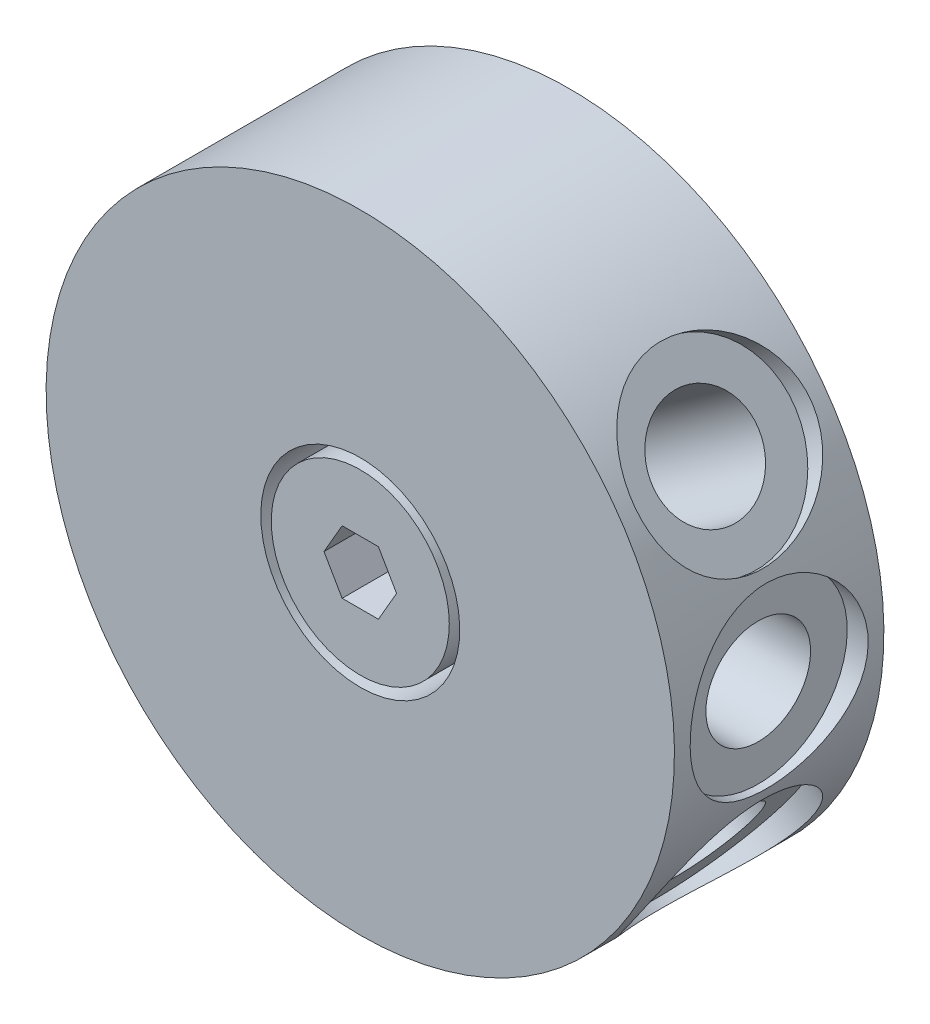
ISO-10303-21;
HEADER;
FILE_DESCRIPTION(('STEP AP214'),'2;1');
FILE_NAME('part.step','',(''),(''),'','','');
FILE_SCHEMA(('AUTOMOTIVE_DESIGN { 1 0 10303 214 1 1 1 1 }'));
ENDSEC;
DATA;
#1=APPLICATION_CONTEXT('core data for automotive mechanical design processes');
#2=APPLICATION_PROTOCOL_DEFINITION('international standard','automotive_design',2000,#1);
#3=PRODUCT_CONTEXT('',#1,'mechanical');
#4=PRODUCT('Part','Part','',(#3));
#5=PRODUCT_RELATED_PRODUCT_CATEGORY('part','',(#4));
#6=PRODUCT_DEFINITION_FORMATION('','',#4);
#7=PRODUCT_DEFINITION_CONTEXT('part definition',#1,'design');
#8=PRODUCT_DEFINITION('design','',#6,#7);
#9=PRODUCT_DEFINITION_SHAPE('','',#8);
#10=(LENGTH_UNIT() NAMED_UNIT(*) SI_UNIT(.MILLI.,.METRE.));
#11=(NAMED_UNIT(*) PLANE_ANGLE_UNIT() SI_UNIT($,.RADIAN.));
#12=(NAMED_UNIT(*) SI_UNIT($,.STERADIAN.) SOLID_ANGLE_UNIT());
#13=UNCERTAINTY_MEASURE_WITH_UNIT(LENGTH_MEASURE(1.E-05),#10,'distance_accuracy_value','');
#14=(GEOMETRIC_REPRESENTATION_CONTEXT(3) GLOBAL_UNCERTAINTY_ASSIGNED_CONTEXT((#13)) GLOBAL_UNIT_ASSIGNED_CONTEXT((#10,
#11,#12)) REPRESENTATION_CONTEXT('',''));
#15=CARTESIAN_POINT('',(0.,0.,0.));
#16=DIRECTION('',(0.,0.,1.));
#17=DIRECTION('',(1.,0.,0.));
#18=AXIS2_PLACEMENT_3D('',#15,#16,#17);
#19=CARTESIAN_POINT('',(7.,0.,5.));
#20=DIRECTION('',(1.,0.,0.));
#21=DIRECTION('',(0.,0.,-1.));
#22=AXIS2_PLACEMENT_3D('',#19,#20,#21);
#23=PLANE('',#22);
#24=CARTESIAN_POINT('',(7.,0.,5.));
#25=DIRECTION('',(1.,0.,0.));
#26=DIRECTION('',(0.,1.,0.));
#27=AXIS2_PLACEMENT_3D('',#24,#25,#26);
#28=CIRCLE('',#27,2.5);
#29=CARTESIAN_POINT('',(7.,2.20709152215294,6.17420058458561));
#30=VERTEX_POINT('',#29);
#31=CARTESIAN_POINT('',(7.,-2.20709152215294,6.17420058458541));
#32=VERTEX_POINT('',#31);
#33=EDGE_CURVE('E167',#30,#32,#28,.T.);
#34=ORIENTED_EDGE('',*,*,#33,.T.);
#35=DIRECTION('',(0.,0.,-1.));
#36=VECTOR('',#35,1.);
#37=CARTESIAN_POINT('',(7.,-2.20709152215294,5.));
#38=LINE('',#37,#36);
#39=CARTESIAN_POINT('',(7.,-2.20709152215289,3.82579941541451));
#40=VERTEX_POINT('',#39);
#41=EDGE_CURVE('E126',#32,#40,#38,.T.);
#42=ORIENTED_EDGE('',*,*,#41,.T.);
#43=CARTESIAN_POINT('',(7.,2.20709152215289,3.82579941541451));
#44=VERTEX_POINT('',#43);
#45=EDGE_CURVE('E166',#40,#44,#28,.T.);
#46=ORIENTED_EDGE('',*,*,#45,.T.);
#47=DIRECTION('',(0.,0.,1.));
#48=VECTOR('',#47,1.);
#49=CARTESIAN_POINT('',(7.,2.20709152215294,7.1));
#50=LINE('',#49,#48);
#51=EDGE_CURVE('E136',#44,#30,#50,.T.);
#52=ORIENTED_EDGE('',*,*,#51,.T.);
#53=EDGE_LOOP('',(#34,#42,#46,#52));
#54=FACE_BOUND('',#53,.T.);
#55=ADVANCED_FACE('F14',(#54),#23,.T.);
#56=CARTESIAN_POINT('',(4.,0.,5.));
#57=DIRECTION('',(1.,0.,0.));
#58=DIRECTION('',(0.,0.,-1.));
#59=AXIS2_PLACEMENT_3D('',#56,#57,#58);
#60=CYLINDRICAL_SURFACE('',#59,2.5);
#61=CARTESIAN_POINT('',(14.,0.,5.));
#62=DIRECTION('',(1.,0.,0.));
#63=DIRECTION('',(0.,1.,0.));
#64=AXIS2_PLACEMENT_3D('',#61,#62,#63);
#65=CIRCLE('',#64,2.5);
#66=CARTESIAN_POINT('',(14.,2.5,5.));
#67=VERTEX_POINT('',#66);
#68=EDGE_CURVE('E170',#67,#67,#65,.T.);
#69=ORIENTED_EDGE('',*,*,#68,.T.);
#70=EDGE_LOOP('',(#69));
#71=FACE_BOUND('',#70,.T.);
#72=CARTESIAN_POINT('',(0.,0.,5.));
#73=DIRECTION('',(0.300705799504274,0.953716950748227,0.));
#74=DIRECTION('',(0.953716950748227,-0.300705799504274,0.));
#75=AXIS2_PLACEMENT_3D('',#72,#73,#74);
#76=ELLIPSE('',#75,8.31377380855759,2.5);
#77=EDGE_CURVE('E22',#32,#40,#76,.T.);
#78=ORIENTED_EDGE('',*,*,#77,.F.);
#79=ORIENTED_EDGE('',*,*,#33,.F.);
#80=CARTESIAN_POINT('',(0.,0.,5.));
#81=DIRECTION('',(-0.300705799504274,0.953716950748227,0.));
#82=DIRECTION('',(0.953716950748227,0.300705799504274,0.));
#83=AXIS2_PLACEMENT_3D('',#80,#81,#82);
#84=ELLIPSE('',#83,8.31377380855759,2.5);
#85=EDGE_CURVE('E139',#30,#44,#84,.T.);
#86=ORIENTED_EDGE('',*,*,#85,.T.);
#87=ORIENTED_EDGE('',*,*,#45,.F.);
#88=EDGE_LOOP('',(#78,#79,#86,#87));
#89=FACE_BOUND('',#88,.T.);
#90=ADVANCED_FACE('F225',(#71,#89),#60,.F.);
#91=CARTESIAN_POINT('',(5.73406431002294,4.01503505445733,7.1));
#92=DIRECTION('',(-0.819152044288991,-0.573576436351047,0.));
#93=DIRECTION('',(0.573576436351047,-0.819152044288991,0.));
#94=AXIS2_PLACEMENT_3D('',#91,#92,#93);
#95=PLANE('',#94);
#96=ORIENTED_EDGE('',*,*,#51,.F.);
#97=CARTESIAN_POINT('',(5.73406431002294,4.01503505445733,5.));
#98=DIRECTION('',(0.819152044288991,0.573576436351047,0.));
#99=DIRECTION('',(-0.573576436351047,0.819152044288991,0.));
#100=AXIS2_PLACEMENT_3D('',#97,#98,#99);
#101=CIRCLE('',#100,2.5);
#102=EDGE_CURVE('E150',#44,#30,#101,.T.);
#103=ORIENTED_EDGE('',*,*,#102,.T.);
#104=EDGE_LOOP('',(#96,#103));
#105=FACE_BOUND('',#104,.T.);
#106=ADVANCED_FACE('F232',(#105),#95,.F.);
#107=CARTESIAN_POINT('',(11.4681286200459,8.03007010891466,5.));
#108=DIRECTION('',(0.819152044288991,0.573576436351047,0.));
#109=DIRECTION('',(-0.573576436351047,0.819152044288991,0.));
#110=AXIS2_PLACEMENT_3D('',#107,#108,#109);
#111=CYLINDRICAL_SURFACE('',#110,2.5);
#112=CARTESIAN_POINT('',(11.4681286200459,8.03007010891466,5.));
#113=DIRECTION('',(0.819152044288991,0.573576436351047,0.));
#114=DIRECTION('',(-0.573576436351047,0.819152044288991,0.));
#115=AXIS2_PLACEMENT_3D('',#112,#113,#114);
#116=CIRCLE('',#115,2.5);
#117=CARTESIAN_POINT('',(10.0341875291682,10.0779502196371,5.));
#118=VERTEX_POINT('',#117);
#119=EDGE_CURVE('E153',#118,#118,#116,.T.);
#120=ORIENTED_EDGE('',*,*,#119,.T.);
#121=EDGE_LOOP('',(#120));
#122=FACE_BOUND('',#121,.T.);
#123=ORIENTED_EDGE('',*,*,#85,.F.);
#124=ORIENTED_EDGE('',*,*,#102,.F.);
#125=EDGE_LOOP('',(#123,#124));
#126=FACE_BOUND('',#125,.T.);
#127=ADVANCED_FACE('F240',(#122,#126),#111,.F.);
#128=CARTESIAN_POINT('',(0.,0.,6.5));
#129=DIRECTION('',(0.,0.,1.));
#130=DIRECTION('',(0.,-1.,0.));
#131=AXIS2_PLACEMENT_3D('',#128,#129,#130);
#132=PLANE('',#131);
#133=CARTESIAN_POINT('',(0.,0.,6.5));
#134=DIRECTION('',(0.,0.,1.));
#135=DIRECTION('',(1.,0.,0.));
#136=AXIS2_PLACEMENT_3D('',#133,#134,#135);
#137=CIRCLE('',#136,4.25);
#138=CARTESIAN_POINT('',(4.25,0.,6.5));
#139=VERTEX_POINT('',#138);
#140=EDGE_CURVE('E270',#139,#139,#137,.F.);
#141=ORIENTED_EDGE('',*,*,#140,.T.);
#142=EDGE_LOOP('',(#141));
#143=FACE_BOUND('',#142,.T.);
#144=CARTESIAN_POINT('',(0.,0.,6.5));
#145=DIRECTION('',(0.,0.,1.));
#146=DIRECTION('',(0.,-1.,0.));
#147=AXIS2_PLACEMENT_3D('',#144,#145,#146);
#148=CIRCLE('',#147,4.75);
#149=CARTESIAN_POINT('',(0.,-4.75,6.5));
#150=VERTEX_POINT('',#149);
#151=EDGE_CURVE('E146',#150,#150,#148,.T.);
#152=ORIENTED_EDGE('',*,*,#151,.T.);
#153=EDGE_LOOP('',(#152));
#154=FACE_BOUND('',#153,.T.);
#155=ADVANCED_FACE('F237',(#143,#154),#132,.T.);
#156=CARTESIAN_POINT('',(0.,0.,10.));
#157=DIRECTION('',(0.,0.,-1.));
#158=DIRECTION('',(0.131774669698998,0.991279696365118,0.));
#159=AXIS2_PLACEMENT_3D('',#156,#157,#158);
#160=CYLINDRICAL_SURFACE('',#159,4.25);
#161=ORIENTED_EDGE('',*,*,#140,.F.);
#162=EDGE_LOOP('',(#161));
#163=FACE_BOUND('',#162,.T.);
#164=CARTESIAN_POINT('',(0.,0.,10.));
#165=DIRECTION('',(0.,0.,1.));
#166=DIRECTION('',(-0.131774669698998,-0.991279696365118,0.));
#167=AXIS2_PLACEMENT_3D('',#164,#165,#166);
#168=CIRCLE('',#167,4.25);
#169=CARTESIAN_POINT('',(-0.560042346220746,-4.21293870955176,10.));
#170=VERTEX_POINT('',#169);
#171=EDGE_CURVE('E147',#170,#170,#168,.T.);
#172=ORIENTED_EDGE('',*,*,#171,.F.);
#173=EDGE_LOOP('',(#172));
#174=FACE_BOUND('',#173,.T.);
#175=ADVANCED_FACE('F16',(#163,#174),#160,.T.);
#176=CARTESIAN_POINT('',(5.73406431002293,-4.01503505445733,7.1));
#177=DIRECTION('',(-0.819152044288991,0.573576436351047,0.));
#178=DIRECTION('',(-0.573576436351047,-0.819152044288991,0.));
#179=AXIS2_PLACEMENT_3D('',#176,#177,#178);
#180=PLANE('',#179);
#181=CARTESIAN_POINT('',(5.73406431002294,-4.01503505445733,5.));
#182=DIRECTION('',(0.819152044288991,-0.573576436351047,0.));
#183=DIRECTION('',(0.573576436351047,0.819152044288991,0.));
#184=AXIS2_PLACEMENT_3D('',#181,#182,#183);
#185=CIRCLE('',#184,2.5);
#186=EDGE_CURVE('E36',#32,#40,#185,.T.);
#187=ORIENTED_EDGE('',*,*,#186,.T.);
#188=ORIENTED_EDGE('',*,*,#41,.F.);
#189=EDGE_LOOP('',(#187,#188));
#190=FACE_BOUND('',#189,.T.);
#191=ADVANCED_FACE('F246',(#190),#180,.F.);
#192=CARTESIAN_POINT('',(0.,0.,6.5));
#193=DIRECTION('',(0.,0.,1.));
#194=DIRECTION('',(0.,-1.,0.));
#195=AXIS2_PLACEMENT_3D('',#192,#193,#194);
#196=CYLINDRICAL_SURFACE('',#195,4.75);
#197=ORIENTED_EDGE('',*,*,#151,.F.);
#198=EDGE_LOOP('',(#197));
#199=FACE_BOUND('',#198,.T.);
#200=CARTESIAN_POINT('',(0.,0.,10.));
#201=DIRECTION('',(0.,0.,1.));
#202=DIRECTION('',(0.,-1.,0.));
#203=AXIS2_PLACEMENT_3D('',#200,#201,#202);
#204=CIRCLE('',#203,4.75);
#205=CARTESIAN_POINT('',(0.,-4.75,10.));
#206=VERTEX_POINT('',#205);
#207=EDGE_CURVE('E143',#206,#206,#204,.T.);
#208=ORIENTED_EDGE('',*,*,#207,.T.);
#209=EDGE_LOOP('',(#208));
#210=FACE_BOUND('',#209,.T.);
#211=ADVANCED_FACE('F242',(#199,#210),#196,.F.);
#212=CARTESIAN_POINT('',(11.4681286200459,-8.03007010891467,5.));
#213=DIRECTION('',(0.819152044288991,-0.573576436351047,0.));
#214=DIRECTION('',(0.573576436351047,0.819152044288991,0.));
#215=AXIS2_PLACEMENT_3D('',#212,#213,#214);
#216=CYLINDRICAL_SURFACE('',#215,2.5);
#217=CARTESIAN_POINT('',(11.4681286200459,-8.03007010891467,5.));
#218=DIRECTION('',(0.819152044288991,-0.573576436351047,0.));
#219=DIRECTION('',(0.573576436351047,0.819152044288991,0.));
#220=AXIS2_PLACEMENT_3D('',#217,#218,#219);
#221=CIRCLE('',#220,2.5);
#222=CARTESIAN_POINT('',(12.9020697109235,-5.98218999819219,5.));
#223=VERTEX_POINT('',#222);
#224=EDGE_CURVE('E160',#223,#223,#221,.T.);
#225=ORIENTED_EDGE('',*,*,#224,.T.);
#226=EDGE_LOOP('',(#225));
#227=FACE_BOUND('',#226,.T.);
#228=ORIENTED_EDGE('',*,*,#186,.F.);
#229=ORIENTED_EDGE('',*,*,#77,.T.);
#230=EDGE_LOOP('',(#228,#229));
#231=FACE_BOUND('',#230,.T.);
#232=ADVANCED_FACE('F245',(#227,#231),#216,.F.);
#233=CARTESIAN_POINT('',(14.,0.,5.));
#234=DIRECTION('',(1.,0.,0.));
#235=DIRECTION('',(0.,1.,0.));
#236=AXIS2_PLACEMENT_3D('',#233,#234,#235);
#237=PLANE('',#236);
#238=ORIENTED_EDGE('',*,*,#68,.F.);
#239=EDGE_LOOP('',(#238));
#240=FACE_BOUND('',#239,.T.);
#241=CARTESIAN_POINT('',(14.,0.,5.));
#242=DIRECTION('',(1.,0.,0.));
#243=DIRECTION('',(0.,1.,0.));
#244=AXIS2_PLACEMENT_3D('',#241,#242,#243);
#245=CIRCLE('',#244,4.25);
#246=CARTESIAN_POINT('',(14.,4.25,5.));
#247=VERTEX_POINT('',#246);
#248=EDGE_CURVE('E173',#247,#247,#245,.T.);
#249=ORIENTED_EDGE('',*,*,#248,.T.);
#250=EDGE_LOOP('',(#249));
#251=FACE_BOUND('',#250,.T.);
#252=ADVANCED_FACE('F208',(#240,#251),#237,.T.);
#253=CARTESIAN_POINT('',(11.4681286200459,-8.03007010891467,5.));
#254=DIRECTION('',(0.819152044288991,-0.573576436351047,0.));
#255=DIRECTION('',(0.573576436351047,0.819152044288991,0.));
#256=AXIS2_PLACEMENT_3D('',#253,#254,#255);
#257=PLANE('',#256);
#258=ORIENTED_EDGE('',*,*,#224,.F.);
#259=EDGE_LOOP('',(#258));
#260=FACE_BOUND('',#259,.T.);
#261=CARTESIAN_POINT('',(11.4681286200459,-8.03007010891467,5.));
#262=DIRECTION('',(0.819152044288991,-0.573576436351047,0.));
#263=DIRECTION('',(0.573576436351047,0.819152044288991,0.));
#264=AXIS2_PLACEMENT_3D('',#261,#262,#263);
#265=CIRCLE('',#264,4.25);
#266=CARTESIAN_POINT('',(13.9058284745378,-4.54867392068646,5.));
#267=VERTEX_POINT('',#266);
#268=EDGE_CURVE('E163',#267,#267,#265,.T.);
#269=ORIENTED_EDGE('',*,*,#268,.T.);
#270=EDGE_LOOP('',(#269));
#271=FACE_BOUND('',#270,.T.);
#272=ADVANCED_FACE('F256',(#260,#271),#257,.T.);
#273=CARTESIAN_POINT('',(11.4681286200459,8.03007010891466,5.));
#274=DIRECTION('',(0.819152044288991,0.573576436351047,0.));
#275=DIRECTION('',(-0.573576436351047,0.819152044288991,0.));
#276=AXIS2_PLACEMENT_3D('',#273,#274,#275);
#277=PLANE('',#276);
#278=ORIENTED_EDGE('',*,*,#119,.F.);
#279=EDGE_LOOP('',(#278));
#280=FACE_BOUND('',#279,.T.);
#281=CARTESIAN_POINT('',(11.4681286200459,8.03007010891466,5.));
#282=DIRECTION('',(0.819152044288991,0.573576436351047,0.));
#283=DIRECTION('',(-0.573576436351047,0.819152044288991,0.));
#284=AXIS2_PLACEMENT_3D('',#281,#282,#283);
#285=CIRCLE('',#284,4.25);
#286=CARTESIAN_POINT('',(9.03042876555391,11.5114662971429,5.));
#287=VERTEX_POINT('',#286);
#288=EDGE_CURVE('E156',#287,#287,#285,.T.);
#289=ORIENTED_EDGE('',*,*,#288,.T.);
#290=EDGE_LOOP('',(#289));
#291=FACE_BOUND('',#290,.T.);
#292=ADVANCED_FACE('F206',(#280,#291),#277,.T.);
#293=CARTESIAN_POINT('',(14.,0.,5.));
#294=DIRECTION('',(1.,0.,0.));
#295=DIRECTION('',(0.,1.,0.));
#296=AXIS2_PLACEMENT_3D('',#293,#294,#295);
#297=CYLINDRICAL_SURFACE('',#296,4.25);
#298=ORIENTED_EDGE('',*,*,#248,.F.);
#299=EDGE_LOOP('',(#298));
#300=FACE_BOUND('',#299,.T.);
#301=CARTESIAN_POINT('',(14.3853223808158,4.25,5.));
#302=CARTESIAN_POINT('',(14.3853257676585,4.24999559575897,4.76647657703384));
#303=CARTESIAN_POINT('',(14.3910709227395,4.23068745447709,4.53290840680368));
#304=CARTESIAN_POINT('',(14.4133510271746,4.1541366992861,4.07255799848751));
#305=CARTESIAN_POINT('',(14.4298904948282,4.09687819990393,3.84577864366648));
#306=CARTESIAN_POINT('',(14.4717389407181,3.94649274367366,3.40573377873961));
#307=CARTESIAN_POINT('',(14.4970344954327,3.85342066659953,3.19244817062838));
#308=CARTESIAN_POINT('',(14.5535273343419,3.63422631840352,2.7844755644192));
#309=CARTESIAN_POINT('',(14.5847252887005,3.50810029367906,2.58979068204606));
#310=CARTESIAN_POINT('',(14.6504950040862,3.22256871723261,2.21905055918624));
#311=CARTESIAN_POINT('',(14.6851325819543,3.06239547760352,2.0435981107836));
#312=CARTESIAN_POINT('',(14.7533135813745,2.71496442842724,1.72165149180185));
#313=CARTESIAN_POINT('',(14.7868568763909,2.52770350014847,1.57516066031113));
#314=CARTESIAN_POINT('',(14.8498107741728,2.12718013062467,1.31273160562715));
#315=CARTESIAN_POINT('',(14.879134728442,1.91350533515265,1.19740012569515));
#316=CARTESIAN_POINT('',(14.9295861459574,1.46882520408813,1.0045334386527));
#317=CARTESIAN_POINT('',(14.9507151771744,1.23782319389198,0.926991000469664));
#318=CARTESIAN_POINT('',(14.981930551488,0.771345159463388,0.813875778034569));
#319=CARTESIAN_POINT('',(14.9922866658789,0.536136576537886,0.777275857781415));
#320=CARTESIAN_POINT('',(15.0017358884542,0.0627048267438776,0.743845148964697));
#321=CARTESIAN_POINT('',(15.0008311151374,-0.17551776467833,0.747006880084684));
#322=CARTESIAN_POINT('',(14.9880547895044,-0.64103860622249,0.79230284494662));
#323=CARTESIAN_POINT('',(14.9764958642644,-0.868454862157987,0.833326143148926));
#324=CARTESIAN_POINT('',(14.9440842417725,-1.3130322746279,0.951376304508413));
#325=CARTESIAN_POINT('',(14.9232309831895,-1.53019281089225,1.02840534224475));
#326=CARTESIAN_POINT('',(14.8741254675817,-1.95083500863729,1.21708295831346));
#327=CARTESIAN_POINT('',(14.8457956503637,-2.15414338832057,1.32909683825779));
#328=CARTESIAN_POINT('',(14.7847667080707,-2.53944525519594,1.58428015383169));
#329=CARTESIAN_POINT('',(14.7520666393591,-2.7214341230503,1.72745632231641));
#330=CARTESIAN_POINT('',(14.6844871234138,-3.06556343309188,2.04673271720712));
#331=CARTESIAN_POINT('',(14.6495714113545,-3.22680146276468,2.22379914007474));
#332=CARTESIAN_POINT('',(14.582499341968,-3.51753241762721,2.60281120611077));
#333=CARTESIAN_POINT('',(14.550343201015,-3.64702285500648,2.80475879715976));
#334=CARTESIAN_POINT('',(14.4922713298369,-3.87139073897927,3.2299593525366));
#335=CARTESIAN_POINT('',(14.4664058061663,-3.96599263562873,3.45336506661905));
#336=CARTESIAN_POINT('',(14.4244517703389,-4.11598413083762,3.91383194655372));
#337=CARTESIAN_POINT('',(14.4083604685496,-4.17138491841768,4.15088919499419));
#338=CARTESIAN_POINT('',(14.3883799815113,-4.23978267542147,4.62341696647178));
#339=CARTESIAN_POINT('',(14.384099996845,-4.25413830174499,4.85867449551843));
#340=CARTESIAN_POINT('',(14.3871518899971,-4.2438064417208,5.3282349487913));
#341=CARTESIAN_POINT('',(14.394482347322,-4.21912373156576,5.56253798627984));
#342=CARTESIAN_POINT('',(14.4195486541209,-4.13261985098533,6.01809657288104));
#343=CARTESIAN_POINT('',(14.4370476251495,-4.07164339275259,6.23952685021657));
#344=CARTESIAN_POINT('',(14.4802410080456,-3.91524700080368,6.66900918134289));
#345=CARTESIAN_POINT('',(14.5059365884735,-3.81982215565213,6.87705932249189));
#346=CARTESIAN_POINT('',(14.5634083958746,-3.59456841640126,7.27948293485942));
#347=CARTESIAN_POINT('',(14.5953176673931,-3.46395703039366,7.47339895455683));
#348=CARTESIAN_POINT('',(14.6613220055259,-3.17298767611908,7.83705912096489));
#349=CARTESIAN_POINT('',(14.695417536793,-3.01262337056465,8.00679810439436));
#350=CARTESIAN_POINT('',(14.7633202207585,-2.66036524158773,8.32307224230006));
#351=CARTESIAN_POINT('',(14.7970803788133,-2.46760271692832,8.46865211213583));
#352=CARTESIAN_POINT('',(14.8593596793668,-2.05959985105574,8.72540355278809));
#353=CARTESIAN_POINT('',(14.8878790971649,-1.84436069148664,8.83657693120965));
#354=CARTESIAN_POINT('',(14.9362813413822,-1.39901069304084,9.02030195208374));
#355=CARTESIAN_POINT('',(14.9562293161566,-1.16902787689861,9.09314591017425));
#356=CARTESIAN_POINT('',(14.9855287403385,-0.699427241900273,9.19895126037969));
#357=CARTESIAN_POINT('',(14.9948828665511,-0.459811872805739,9.23192272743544));
#358=CARTESIAN_POINT('',(15.0017963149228,0.0133761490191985,9.25634936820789));
#359=CARTESIAN_POINT('',(14.9997514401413,0.246872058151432,9.24919766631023));
#360=CARTESIAN_POINT('',(14.9850101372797,0.709199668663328,9.19686217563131));
#361=CARTESIAN_POINT('',(14.9723142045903,0.938031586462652,9.15168015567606));
#362=CARTESIAN_POINT('',(14.9377931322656,1.38263253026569,9.02539277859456));
#363=CARTESIAN_POINT('',(14.9160480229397,1.59849753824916,8.94460198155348));
#364=CARTESIAN_POINT('',(14.8656883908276,2.01372839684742,8.74967016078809));
#365=CARTESIAN_POINT('',(14.83707281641,2.21309171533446,8.63552403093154));
#366=CARTESIAN_POINT('',(14.7749610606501,2.59601249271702,8.37322491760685));
#367=CARTESIAN_POINT('',(14.7413462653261,2.77893415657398,8.22417200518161));
#368=CARTESIAN_POINT('',(14.673453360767,3.11763798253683,7.89795483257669));
#369=CARTESIAN_POINT('',(14.6391750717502,3.2734126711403,7.72078285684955));
#370=CARTESIAN_POINT('',(14.5728102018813,3.55739493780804,7.33788332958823));
#371=CARTESIAN_POINT('',(14.540802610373,3.68479095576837,7.13153881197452));
#372=CARTESIAN_POINT('',(14.4837853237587,3.9029158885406,6.6994799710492));
#373=CARTESIAN_POINT('',(14.4587716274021,3.99366578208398,6.47377681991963));
#374=CARTESIAN_POINT('',(14.4215691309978,4.12581838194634,6.04119156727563));
#375=CARTESIAN_POINT('',(14.4080952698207,4.17226825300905,5.83594949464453));
#376=CARTESIAN_POINT('',(14.3899710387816,4.23435870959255,5.42048319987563));
#377=CARTESIAN_POINT('',(14.3853193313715,4.250003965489,5.21025973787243));
#378=CARTESIAN_POINT('',(14.3853223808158,4.25,5.));
#379=B_SPLINE_CURVE_WITH_KNOTS('',3,(#301,#302,#303,#304,#305,#306,#307,#308,#309,#310,#311,
#312,#313,#314,#315,#316,#317,#318,#319,#320,#321,#322,#323,#324,#325,#326,#327,#328,#329,#330,
#331,#332,#333,#334,#335,#336,#337,#338,#339,#340,#341,#342,#343,#344,#345,#346,#347,#348,#349,
#350,#351,#352,#353,#354,#355,#356,#357,#358,#359,#360,#361,#362,#363,#364,#365,#366,#367,#368,
#369,#370,#371,#372,#373,#374,#375,#376,#377,#378),.UNSPECIFIED.,.T.,.F.,(4,2,2,2,2,2,2,2,2,2,2,
2,2,2,2,2,2,2,2,2,2,2,2,2,2,2,2,2,2,2,2,2,2,2,2,2,2,2,4),(0.,0.699795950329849,1.39988501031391,
2.09890551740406,2.79800543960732,3.51496036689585,4.23199790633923,4.9621287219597,
5.69211976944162,6.40335519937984,7.11445682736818,7.80533472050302,8.49625434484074,
9.19464418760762,9.89318507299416,10.6158478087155,11.3385671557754,12.0668781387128,
12.7949811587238,13.498687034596,14.2023068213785,14.89015768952,15.5781066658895,
16.2828380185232,16.9877196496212,17.715958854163,18.4441597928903,19.1667235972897,
19.8891047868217,20.5865627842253,21.2839883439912,21.9753727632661,22.6668630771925,
23.3786525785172,24.0906377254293,24.8209248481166,25.5507933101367,26.180970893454,
26.8110529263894),.UNSPECIFIED.);
#380=CARTESIAN_POINT('',(14.3853223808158,4.25,5.));
#381=VERTEX_POINT('',#380);
#382=EDGE_CURVE('E182',#381,#381,#379,.T.);
#383=ORIENTED_EDGE('',*,*,#382,.F.);
#384=EDGE_LOOP('',(#383));
#385=FACE_BOUND('',#384,.T.);
#386=ADVANCED_FACE('F200',(#300,#385),#297,.F.);
#387=CARTESIAN_POINT('',(11.4681286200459,-8.03007010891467,5.));
#388=DIRECTION('',(0.819152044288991,-0.573576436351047,0.));
#389=DIRECTION('',(0.573576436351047,0.819152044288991,0.));
#390=AXIS2_PLACEMENT_3D('',#387,#388,#389);
#391=CYLINDRICAL_SURFACE('',#390,4.25);
#392=ORIENTED_EDGE('',*,*,#268,.F.);
#393=EDGE_LOOP('',(#392));
#394=FACE_BOUND('',#393,.T.);
#395=CARTESIAN_POINT('',(14.2214660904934,-4.76968575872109,5.));
#396=CARTESIAN_POINT('',(14.2214663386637,-4.76969130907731,4.76647657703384));
#397=CARTESIAN_POINT('',(14.2150977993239,-4.78880289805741,4.53290840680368));
#398=CARTESIAN_POINT('',(14.1894408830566,-4.86428894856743,4.07255799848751));
#399=CARTESIAN_POINT('',(14.1701470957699,-4.92067901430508,3.84577864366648));
#400=CARTESIAN_POINT('',(14.1181697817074,-5.06787085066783,3.4057337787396));
#401=CARTESIAN_POINT('',(14.0855067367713,-5.15861996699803,3.19244817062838));
#402=CARTESIAN_POINT('',(14.006058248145,-5.37057642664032,2.7844755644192));
#403=CARTESIAN_POINT('',(13.9592712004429,-5.49178722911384,2.58979068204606));
#404=CARTESIAN_POINT('',(13.8493724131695,-5.76340496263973,2.21905055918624));
#405=CARTESIAN_POINT('',(13.7858742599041,-5.91447849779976,2.0435981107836));
#406=CARTESIAN_POINT('',(13.6424466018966,-6.23818436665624,1.72165149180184));
#407=CARTESIAN_POINT('',(13.5625152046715,-6.41081918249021,1.57516066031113));
#408=CARTESIAN_POINT('',(13.3843532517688,-6.77501759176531,1.31273160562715));
#409=CARTESIAN_POINT('',(13.2858152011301,-6.96686926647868,1.19740012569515));
#410=CARTESIAN_POINT('',(13.0720845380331,-7.36006764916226,1.0045334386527));
#411=CARTESIAN_POINT('',(12.9568951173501,-7.56141253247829,0.926991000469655));
#412=CARTESIAN_POINT('',(12.7149044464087,-7.96143337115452,0.813875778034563));
#413=CARTESIAN_POINT('',(12.5884775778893,-8.16004498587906,0.777275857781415));
#414=CARTESIAN_POINT('',(12.3246686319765,-8.55327742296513,0.743845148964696));
#415=CARTESIAN_POINT('',(12.1872886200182,-8.74789898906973,0.747006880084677));
#416=CARTESIAN_POINT('',(11.9098110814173,-9.12190313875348,0.792302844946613));
#417=CARTESIAN_POINT('',(11.7699019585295,-9.30156170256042,0.833326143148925));
#418=CARTESIAN_POINT('',(11.4883527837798,-9.64714765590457,0.951376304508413));
#419=CARTESIAN_POINT('',(11.3467126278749,-9.81307421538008,1.02840534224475));
#420=CARTESIAN_POINT('',(11.0652172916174,-10.1294783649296,1.21708295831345));
#421=CARTESIAN_POINT('',(10.9253979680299,-10.2797695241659,1.32909683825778));
#422=CARTESIAN_POINT('',(10.6544059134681,-10.5603855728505,1.58428015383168));
#423=CARTESIAN_POINT('',(10.5232350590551,-10.6907061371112,1.7274563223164));
#424=CARTESIAN_POINT('',(10.2704926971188,-10.9338383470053,2.04673271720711));
#425=CARTESIAN_POINT('',(10.1494090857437,-11.0458899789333,2.22379914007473));
#426=CARTESIAN_POINT('',(9.92771043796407,-11.2455718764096,2.60281120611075));
#427=CARTESIAN_POINT('',(9.82709700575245,-11.3332002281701,2.80475879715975));
#428=CARTESIAN_POINT('',(9.65083518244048,-11.4836829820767,3.22995935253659));
#429=CARTESIAN_POINT('',(9.57538596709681,-11.5463404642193,3.45336506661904));
#430=CARTESIAN_POINT('',(9.45498764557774,-11.6451424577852,3.9138319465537));
#431=CARTESIAN_POINT('',(9.4100298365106,-11.6812945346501,4.15088919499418));
#432=CARTESIAN_POINT('',(9.35443143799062,-11.7258623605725,4.62341696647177));
#433=CARTESIAN_POINT('',(9.34269143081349,-11.73516690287,4.85867449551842));
#434=CARTESIAN_POINT('',(9.35111750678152,-11.7284540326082,5.32823494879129));
#435=CARTESIAN_POINT('',(9.37127968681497,-11.7124397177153,5.56253798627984));
#436=CARTESIAN_POINT('',(9.44142939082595,-11.6559573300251,6.01809657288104));
#437=CARTESIAN_POINT('',(9.49073836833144,-11.6160453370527,6.23952685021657));
#438=CARTESIAN_POINT('',(9.61582560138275,-11.5127076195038,6.66900918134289));
#439=CARTESIAN_POINT('',(9.69160763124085,-11.4492785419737,6.87705932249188));
#440=CARTESIAN_POINT('',(9.86788601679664,-11.2977259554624,7.27948293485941));
#441=CARTESIAN_POINT('',(9.96894017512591,-11.209037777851,7.47339895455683));
#442=CARTESIAN_POINT('',(10.1899009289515,-11.0085481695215,7.83705912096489));
#443=CARTESIAN_POINT('',(10.3098115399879,-10.8967418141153,8.00679810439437));
#444=CARTESIAN_POINT('',(10.5674811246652,-10.647136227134,8.32307224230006));
#445=CARTESIAN_POINT('',(10.7056998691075,-10.5085984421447,8.46865211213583));
#446=CARTESIAN_POINT('',(10.990736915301,-10.2101039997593,8.7254035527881));
#447=CARTESIAN_POINT('',(11.1375547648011,-10.0501484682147,8.83657693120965));
#448=CARTESIAN_POINT('',(11.4326458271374,-9.71310149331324,9.02030195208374));
#449=CARTESIAN_POINT('',(11.5808989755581,-9.53615228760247,9.09314591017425));
#450=CARTESIAN_POINT('',(11.8742515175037,-9.16828342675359,9.19895126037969));
#451=CARTESIAN_POINT('',(12.0193516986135,-8.97736731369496,9.23192272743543));
#452=CARTESIAN_POINT('',(12.2964243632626,-8.59371976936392,9.25634936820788));
#453=CARTESIAN_POINT('',(12.4286770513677,-8.40127822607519,9.24919766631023));
#454=CARTESIAN_POINT('',(12.6817819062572,-8.01410635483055,9.19686217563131));
#455=CARTESIAN_POINT('',(12.8026346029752,-7.81937613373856,9.15168015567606));
#456=CARTESIAN_POINT('',(13.0293692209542,-7.43537988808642,9.02539277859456));
#457=CARTESIAN_POINT('',(13.1353717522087,-7.24608114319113,8.94460198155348));
#458=CARTESIAN_POINT('',(13.3322861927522,-6.87705883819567,8.74967016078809));
#459=CARTESIAN_POINT('',(13.4231957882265,-6.6973367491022,8.63552403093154));
#460=CARTESIAN_POINT('',(13.5919511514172,-6.34804057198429,8.37322491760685));
#461=CARTESIAN_POINT('',(13.6693350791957,-6.17891926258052,8.22417200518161));
#462=CARTESIAN_POINT('',(13.8079930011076,-5.86252756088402,7.89795483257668));
#463=CARTESIAN_POINT('',(13.8692625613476,-5.71526318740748,7.72078285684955));
#464=CARTESIAN_POINT('',(13.9777851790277,-5.44457320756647,7.33788332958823));
#465=CARTESIAN_POINT('',(14.0246374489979,-5.32185769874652,7.13153881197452));
#466=CARTESIAN_POINT('',(14.1030429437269,-5.11047644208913,6.6994799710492));
#467=CARTESIAN_POINT('',(14.1346049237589,-5.02179121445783,6.47377681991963));
#468=CARTESIAN_POINT('',(14.1799300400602,-4.89219966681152,6.04119156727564));
#469=CARTESIAN_POINT('',(14.1955354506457,-4.84642187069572,5.83594949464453));
#470=CARTESIAN_POINT('',(14.2163025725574,-4.78516471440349,5.42048319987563));
#471=CARTESIAN_POINT('',(14.221465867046,-4.7696807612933,5.21025973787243));
#472=CARTESIAN_POINT('',(14.2214660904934,-4.76968575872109,5.));
#473=B_SPLINE_CURVE_WITH_KNOTS('',3,(#395,#396,#397,#398,#399,#400,#401,#402,#403,#404,#405,
#406,#407,#408,#409,#410,#411,#412,#413,#414,#415,#416,#417,#418,#419,#420,#421,#422,#423,#424,
#425,#426,#427,#428,#429,#430,#431,#432,#433,#434,#435,#436,#437,#438,#439,#440,#441,#442,#443,
#444,#445,#446,#447,#448,#449,#450,#451,#452,#453,#454,#455,#456,#457,#458,#459,#460,#461,#462,
#463,#464,#465,#466,#467,#468,#469,#470,#471,#472),.UNSPECIFIED.,.T.,.F.,(4,2,2,2,2,2,2,2,2,2,2,
2,2,2,2,2,2,2,2,2,2,2,2,2,2,2,2,2,2,2,2,2,2,2,2,2,2,2,4),(0.,0.69979595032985,1.39988501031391,
2.09890551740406,2.79800543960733,3.51496036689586,4.23199790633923,4.96212872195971,
5.69211976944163,6.40335519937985,7.11445682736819,7.80533472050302,8.49625434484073,
9.1946441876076,9.89318507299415,10.6158478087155,11.3385671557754,12.0668781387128,
12.7949811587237,13.498687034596,14.2023068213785,14.89015768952,15.5781066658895,
16.2828380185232,16.9877196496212,17.715958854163,18.4441597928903,19.1667235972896,
19.8891047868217,20.5865627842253,21.2839883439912,21.9753727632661,22.6668630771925,
23.3786525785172,24.0906377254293,24.8209248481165,25.5507933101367,26.180970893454,
26.8110529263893),.UNSPECIFIED.);
#474=CARTESIAN_POINT('',(14.2214660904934,-4.76968575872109,5.));
#475=VERTEX_POINT('',#474);
#476=EDGE_CURVE('E190',#475,#475,#473,.T.);
#477=ORIENTED_EDGE('',*,*,#476,.F.);
#478=EDGE_LOOP('',(#477));
#479=FACE_BOUND('',#478,.T.);
#480=ADVANCED_FACE('F205',(#394,#479),#391,.F.);
#481=CARTESIAN_POINT('',(11.4681286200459,8.03007010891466,5.));
#482=DIRECTION('',(0.819152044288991,0.573576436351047,0.));
#483=DIRECTION('',(-0.573576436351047,0.819152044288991,0.));
#484=AXIS2_PLACEMENT_3D('',#481,#482,#483);
#485=CYLINDRICAL_SURFACE('',#484,4.25);
#486=ORIENTED_EDGE('',*,*,#288,.F.);
#487=EDGE_LOOP('',(#486));
#488=FACE_BOUND('',#487,.T.);
#489=CARTESIAN_POINT('',(9.34606638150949,11.7324781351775,5.));
#490=CARTESIAN_POINT('',(9.3460716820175,11.7324764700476,4.76647657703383));
#491=CARTESIAN_POINT('',(9.36185253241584,11.7199554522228,4.53290840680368));
#492=CARTESIAN_POINT('',(9.42401103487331,11.6700280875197,4.07255799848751));
#493=CARTESIAN_POINT('',(9.47040149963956,11.6326113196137,3.84577864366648));
#494=CARTESIAN_POINT('',(9.59093929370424,11.5334260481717,3.4057337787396));
#495=CARTESIAN_POINT('',(9.66504414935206,11.4716948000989,3.19244817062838));
#496=CARTESIAN_POINT('',(9.83704508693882,11.3245442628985,2.78447556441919));
#497=CARTESIAN_POINT('',(9.93494387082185,11.2391222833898,2.58979068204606));
#498=CARTESIAN_POINT('',(10.1525934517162,11.0429524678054,2.21905055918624));
#499=CARTESIAN_POINT('',(10.2728384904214,10.9316135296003,2.04359811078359));
#500=CARTESIAN_POINT('',(10.5279673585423,10.6861216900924,1.72165149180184));
#501=CARTESIAN_POINT('',(10.6628528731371,10.5519661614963,1.57516066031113));
#502=CARTESIAN_POINT('',(10.9441524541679,10.2599854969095,1.31273160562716));
#503=CARTESIAN_POINT('',(11.090732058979,10.101772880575,1.19740012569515));
#504=CARTESIAN_POINT('',(11.3871174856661,9.76644998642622,1.0045334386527));
#505=CARTESIAN_POINT('',(11.5369226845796,9.58934333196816,0.926991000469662));
#506=CARTESIAN_POINT('',(11.8300536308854,9.2251312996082,0.813875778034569));
#507=CARTESIAN_POINT('',(11.9734469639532,9.03839973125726,0.777275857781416));
#508=CARTESIAN_POINT('',(12.252736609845,8.65600699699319,0.743845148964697));
#509=CARTESIAN_POINT('',(12.3886343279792,8.46034751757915,0.747006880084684));
#510=CARTESIAN_POINT('',(12.6451803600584,8.07168696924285,0.792302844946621));
#511=CARTESIAN_POINT('',(12.7661524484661,7.87876855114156,0.833326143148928));
#512=CARTESIAN_POINT('',(12.9946015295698,7.49600151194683,0.951376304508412));
#513=CARTESIAN_POINT('',(13.1020777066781,7.30615307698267,1.02840534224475));
#514=CARTESIAN_POINT('',(13.3031232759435,6.9334173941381,1.21708295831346));
#515=CARTESIAN_POINT('',(13.3965297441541,6.75062760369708,1.3290968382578));
#516=CARTESIAN_POINT('',(13.5675378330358,6.40000202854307,1.58428015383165));
#517=CARTESIAN_POINT('',(13.6451360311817,6.23216948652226,1.72745632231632));
#518=CARTESIAN_POINT('',(13.7871625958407,5.91151324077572,2.04673271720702));
#519=CARTESIAN_POINT('',(13.8510436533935,5.75940794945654,2.22379914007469));
#520=CARTESIAN_POINT('',(13.9628578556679,5.48278413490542,2.60281120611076));
#521=CARTESIAN_POINT('',(14.0107897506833,5.35826777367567,2.80475879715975));
#522=CARTESIAN_POINT('',(14.0919121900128,5.14116770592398,3.22995935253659));
#523=CARTESIAN_POINT('',(14.1249858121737,5.04883851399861,3.45336506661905));
#524=CARTESIAN_POINT('',(14.1766506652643,4.90190882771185,3.91383194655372));
#525=CARTESIAN_POINT('',(14.1952460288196,4.8472975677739,4.15088919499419));
#526=CARTESIAN_POINT('',(14.2181103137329,4.77980906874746,4.62341696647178));
#527=CARTESIAN_POINT('',(14.2228384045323,4.765594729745,4.85867449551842));
#528=CARTESIAN_POINT('',(14.2194122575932,4.77580858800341,5.3282349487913));
#529=CARTESIAN_POINT('',(14.2112595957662,4.80023205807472,5.56253798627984));
#530=CARTESIAN_POINT('',(14.1821761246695,4.88546933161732,6.01809657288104));
#531=CARTESIAN_POINT('',(14.1615357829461,4.94545531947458,6.23952685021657));
#532=CARTESIAN_POINT('',(14.107212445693,5.09834245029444,6.66900918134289));
#533=CARTESIAN_POINT('',(14.0735275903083,5.19124828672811,6.87705932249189));
#534=CARTESIAN_POINT('',(13.9914055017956,5.40872982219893,7.27948293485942));
#535=CARTESIAN_POINT('',(13.9426284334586,5.53402281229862,7.47339895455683));
#536=CARTESIAN_POINT('',(13.8298028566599,5.81022948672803,7.83705912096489));
#537=CARTESIAN_POINT('',(13.7657510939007,5.96114862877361,8.00679810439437));
#538=CARTESIAN_POINT('',(13.6193267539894,6.28864897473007,8.32307224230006));
#539=CARTESIAN_POINT('',(13.5364174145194,6.46591482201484,8.46865211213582));
#540=CARTESIAN_POINT('',(13.3534128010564,6.83585314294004,8.72540355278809));
#541=CARTESIAN_POINT('',(13.2533184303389,7.02852480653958,8.83657693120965));
#542=CARTESIAN_POINT('',(13.0375249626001,7.42109655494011,9.02030195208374));
#543=CARTESIAN_POINT('',(12.9219526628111,7.62092913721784,9.09314591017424));
#544=CARTESIAN_POINT('',(12.6766014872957,8.02240891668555,9.19895126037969));
#545=CARTESIAN_POINT('',(12.5468262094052,8.22405564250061,9.23192272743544));
#546=CARTESIAN_POINT('',(12.2810798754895,8.61563396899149,9.25634936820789));
#547=CARTESIAN_POINT('',(12.1454770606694,8.80572972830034,9.24919766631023));
#548=CARTESIAN_POINT('',(11.8682214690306,9.17599107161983,9.19686217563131));
#549=CARTESIAN_POINT('',(11.7265689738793,9.35615711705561,9.15168015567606));
#550=CARTESIAN_POINT('',(11.4432783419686,9.70055241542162,9.02539277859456));
#551=CARTESIAN_POINT('',(11.301650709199,9.86490619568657,8.94460198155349));
#552=CARTESIAN_POINT('',(11.0222318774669,10.1761583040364,8.7496701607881));
#553=CARTESIAN_POINT('',(10.8844412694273,10.3230539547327,8.63552403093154));
#554=CARTESIAN_POINT('',(10.6139279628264,10.6010984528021,8.37322491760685));
#555=CARTESIAN_POINT('',(10.4814727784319,10.7316584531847,8.22417200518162));
#556=CARTESIAN_POINT('',(10.2315856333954,10.9701666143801,7.8979548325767));
#557=CARTESIAN_POINT('',(10.1141578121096,11.0781085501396,7.72078285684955));
#558=CARTESIAN_POINT('',(9.89690935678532,11.272667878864,7.33788332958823));
#559=CARTESIAN_POINT('',(9.79761891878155,11.358665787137,7.13153881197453));
#560=CARTESIAN_POINT('',(9.62580177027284,11.5046394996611,6.69947997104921));
#561=CARTESIAN_POINT('',(9.55325974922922,11.56463019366,6.47377681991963));
#562=CARTESIAN_POINT('',(9.44698563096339,11.6515447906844,6.04119156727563));
#563=CARTESIAN_POINT('',(9.40930593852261,11.6818660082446,5.83594949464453));
#564=CARTESIAN_POINT('',(9.35884581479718,11.7223319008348,5.42048319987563));
#565=CARTESIAN_POINT('',(9.34606160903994,11.7324796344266,5.21025973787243));
#566=CARTESIAN_POINT('',(9.34606638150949,11.7324781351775,5.));
#567=B_SPLINE_CURVE_WITH_KNOTS('',3,(#489,#490,#491,#492,#493,#494,#495,#496,#497,#498,#499,
#500,#501,#502,#503,#504,#505,#506,#507,#508,#509,#510,#511,#512,#513,#514,#515,#516,#517,#518,
#519,#520,#521,#522,#523,#524,#525,#526,#527,#528,#529,#530,#531,#532,#533,#534,#535,#536,#537,
#538,#539,#540,#541,#542,#543,#544,#545,#546,#547,#548,#549,#550,#551,#552,#553,#554,#555,#556,
#557,#558,#559,#560,#561,#562,#563,#564,#565,#566),.UNSPECIFIED.,.T.,.F.,(4,2,2,2,2,2,2,2,2,2,2,
2,2,2,2,2,2,2,2,2,2,2,2,2,2,2,2,2,2,2,2,2,2,2,2,2,2,2,4),(0.,0.699795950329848,1.39988501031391,
2.09890551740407,2.79800543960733,3.51496036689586,4.23199790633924,4.9621287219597,
5.69211976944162,6.40335519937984,7.11445682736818,7.80533472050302,8.49625434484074,
9.19464418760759,9.89318507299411,10.6158478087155,11.3385671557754,12.0668781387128,
12.7949811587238,13.498687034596,14.2023068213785,14.89015768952,15.5781066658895,
16.2828380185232,16.9877196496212,17.715958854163,18.4441597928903,19.1667235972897,
19.8891047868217,20.5865627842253,21.2839883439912,21.9753727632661,22.6668630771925,
23.3786525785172,24.0906377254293,24.8209248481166,25.5507933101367,26.180970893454,
26.8110529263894),.UNSPECIFIED.);
#568=CARTESIAN_POINT('',(9.34606638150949,11.7324781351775,5.));
#569=VERTEX_POINT('',#568);
#570=EDGE_CURVE('E264',#569,#569,#567,.T.);
#571=ORIENTED_EDGE('',*,*,#570,.F.);
#572=EDGE_LOOP('',(#571));
#573=FACE_BOUND('',#572,.T.);
#574=ADVANCED_FACE('F258',(#488,#573),#485,.F.);
#575=CARTESIAN_POINT('',(0.,0.,10.));
#576=DIRECTION('',(0.,0.,-1.));
#577=DIRECTION('',(0.,1.,0.));
#578=AXIS2_PLACEMENT_3D('',#575,#576,#577);
#579=CYLINDRICAL_SURFACE('',#578,15.);
#580=ORIENTED_EDGE('',*,*,#570,.T.);
#581=EDGE_LOOP('',(#580));
#582=FACE_BOUND('',#581,.T.);
#583=ORIENTED_EDGE('',*,*,#476,.T.);
#584=EDGE_LOOP('',(#583));
#585=FACE_BOUND('',#584,.T.);
#586=ORIENTED_EDGE('',*,*,#382,.T.);
#587=EDGE_LOOP('',(#586));
#588=FACE_BOUND('',#587,.T.);
#589=CARTESIAN_POINT('',(0.,0.,10.));
#590=DIRECTION('',(0.,0.,1.));
#591=DIRECTION('',(0.,-1.,0.));
#592=AXIS2_PLACEMENT_3D('',#589,#590,#591);
#593=CIRCLE('',#592,15.);
#594=CARTESIAN_POINT('',(0.,-15.,10.));
#595=VERTEX_POINT('',#594);
#596=EDGE_CURVE('E179',#595,#595,#593,.T.);
#597=ORIENTED_EDGE('',*,*,#596,.F.);
#598=EDGE_LOOP('',(#597));
#599=FACE_BOUND('',#598,.T.);
#600=CARTESIAN_POINT('',(0.,0.,0.));
#601=DIRECTION('',(0.,0.,1.));
#602=DIRECTION('',(0.,-1.,0.));
#603=AXIS2_PLACEMENT_3D('',#600,#601,#602);
#604=CIRCLE('',#603,15.);
#605=CARTESIAN_POINT('',(0.,-15.,0.));
#606=VERTEX_POINT('',#605);
#607=EDGE_CURVE('E176',#606,#606,#604,.T.);
#608=ORIENTED_EDGE('',*,*,#607,.T.);
#609=EDGE_LOOP('',(#608));
#610=FACE_BOUND('',#609,.T.);
#611=ADVANCED_FACE('F196',(#582,#585,#588,#599,#610),#579,.T.);
#612=CARTESIAN_POINT('',(0.,0.,0.));
#613=DIRECTION('',(0.,0.,1.));
#614=DIRECTION('',(0.,-1.,0.));
#615=AXIS2_PLACEMENT_3D('',#612,#613,#614);
#616=PLANE('',#615);
#617=ORIENTED_EDGE('',*,*,#607,.F.);
#618=EDGE_LOOP('',(#617));
#619=FACE_BOUND('',#618,.T.);
#620=CARTESIAN_POINT('',(0.,0.,0.));
#621=DIRECTION('',(0.,0.,1.));
#622=DIRECTION('',(1.,0.,0.));
#623=AXIS2_PLACEMENT_3D('',#620,#621,#622);
#624=CIRCLE('',#623,2.5);
#625=CARTESIAN_POINT('',(2.5,0.,0.));
#626=VERTEX_POINT('',#625);
#627=EDGE_CURVE('E9',#626,#626,#624,.T.);
#628=ORIENTED_EDGE('',*,*,#627,.T.);
#629=EDGE_LOOP('',(#628));
#630=FACE_BOUND('',#629,.T.);
#631=ADVANCED_FACE('F209',(#619,#630),#616,.F.);
#632=CARTESIAN_POINT('',(0.,0.,10.));
#633=DIRECTION('',(0.,0.,1.));
#634=DIRECTION('',(0.,-1.,0.));
#635=AXIS2_PLACEMENT_3D('',#632,#633,#634);
#636=PLANE('',#635);
#637=ORIENTED_EDGE('',*,*,#207,.F.);
#638=EDGE_LOOP('',(#637));
#639=FACE_BOUND('',#638,.T.);
#640=ORIENTED_EDGE('',*,*,#596,.T.);
#641=EDGE_LOOP('',(#640));
#642=FACE_BOUND('',#641,.T.);
#643=ADVANCED_FACE('F211',(#639,#642),#636,.T.);
#644=CARTESIAN_POINT('',(0.,0.,10.));
#645=DIRECTION('',(0.,0.,1.));
#646=DIRECTION('',(-0.131774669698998,-0.991279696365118,0.));
#647=AXIS2_PLACEMENT_3D('',#644,#645,#646);
#648=PLANE('',#647);
#649=DIRECTION('',(0.5,0.866025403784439,0.));
#650=VECTOR('',#649,1.);
#651=CARTESIAN_POINT('',(0.866025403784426,-1.5,10.));
#652=LINE('',#651,#650);
#653=CARTESIAN_POINT('',(0.866025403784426,-1.5,10.));
#654=VERTEX_POINT('',#653);
#655=CARTESIAN_POINT('',(1.73205080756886,0.,10.));
#656=VERTEX_POINT('',#655);
#657=EDGE_CURVE('E29',#654,#656,#652,.T.);
#658=ORIENTED_EDGE('',*,*,#657,.F.);
#659=DIRECTION('',(1.,0.,0.));
#660=VECTOR('',#659,1.);
#661=CARTESIAN_POINT('',(-0.866025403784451,-1.5,10.));
#662=LINE('',#661,#660);
#663=CARTESIAN_POINT('',(-0.866025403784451,-1.5,10.));
#664=VERTEX_POINT('',#663);
#665=EDGE_CURVE('E100',#664,#654,#662,.T.);
#666=ORIENTED_EDGE('',*,*,#665,.F.);
#667=DIRECTION('',(0.5,-0.866025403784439,0.));
#668=VECTOR('',#667,1.);
#669=CARTESIAN_POINT('',(-1.73205080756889,0.,10.));
#670=LINE('',#669,#668);
#671=CARTESIAN_POINT('',(-1.73205080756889,0.,10.));
#672=VERTEX_POINT('',#671);
#673=EDGE_CURVE('E103',#672,#664,#670,.T.);
#674=ORIENTED_EDGE('',*,*,#673,.F.);
#675=DIRECTION('',(-0.5,-0.866025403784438,0.));
#676=VECTOR('',#675,1.);
#677=CARTESIAN_POINT('',(-0.866025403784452,1.5,10.));
#678=LINE('',#677,#676);
#679=CARTESIAN_POINT('',(-0.866025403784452,1.5,10.));
#680=VERTEX_POINT('',#679);
#681=EDGE_CURVE('E119',#680,#672,#678,.T.);
#682=ORIENTED_EDGE('',*,*,#681,.F.);
#683=DIRECTION('',(-1.,0.,0.));
#684=VECTOR('',#683,1.);
#685=CARTESIAN_POINT('',(0.866025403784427,1.5,10.));
#686=LINE('',#685,#684);
#687=CARTESIAN_POINT('',(0.866025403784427,1.5,10.));
#688=VERTEX_POINT('',#687);
#689=EDGE_CURVE('E116',#688,#680,#686,.T.);
#690=ORIENTED_EDGE('',*,*,#689,.F.);
#691=DIRECTION('',(-0.5,0.866025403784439,0.));
#692=VECTOR('',#691,1.);
#693=CARTESIAN_POINT('',(1.73205080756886,0.,10.));
#694=LINE('',#693,#692);
#695=EDGE_CURVE('E114',#656,#688,#694,.T.);
#696=ORIENTED_EDGE('',*,*,#695,.F.);
#697=EDGE_LOOP('',(#658,#666,#674,#682,#690,#696));
#698=FACE_BOUND('',#697,.T.);
#699=ORIENTED_EDGE('',*,*,#171,.T.);
#700=EDGE_LOOP('',(#699));
#701=FACE_BOUND('',#700,.T.);
#702=ADVANCED_FACE('F214',(#698,#701),#648,.T.);
#703=CARTESIAN_POINT('',(0.866025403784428,-1.5,7.3));
#704=DIRECTION('',(0.866025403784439,-0.5,0.));
#705=DIRECTION('',(-0.5,-0.866025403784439,0.));
#706=AXIS2_PLACEMENT_3D('',#703,#704,#705);
#707=PLANE('',#706);
#708=ORIENTED_EDGE('',*,*,#657,.T.);
#709=DIRECTION('',(0.,0.,1.));
#710=VECTOR('',#709,1.);
#711=CARTESIAN_POINT('',(1.73205080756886,0.,7.3));
#712=LINE('',#711,#710);
#713=CARTESIAN_POINT('',(1.73205080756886,0.,7.3));
#714=VERTEX_POINT('',#713);
#715=EDGE_CURVE('E77',#714,#656,#712,.T.);
#716=ORIENTED_EDGE('',*,*,#715,.F.);
#717=DIRECTION('',(0.5,0.866025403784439,0.));
#718=VECTOR('',#717,1.);
#719=CARTESIAN_POINT('',(0.866025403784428,-1.5,7.3));
#720=LINE('',#719,#718);
#721=CARTESIAN_POINT('',(0.866025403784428,-1.5,7.3));
#722=VERTEX_POINT('',#721);
#723=EDGE_CURVE('E81',#722,#714,#720,.T.);
#724=ORIENTED_EDGE('',*,*,#723,.F.);
#725=DIRECTION('',(0.,0.,1.));
#726=VECTOR('',#725,1.);
#727=CARTESIAN_POINT('',(0.866025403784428,-1.5,7.3));
#728=LINE('',#727,#726);
#729=EDGE_CURVE('E124',#722,#654,#728,.T.);
#730=ORIENTED_EDGE('',*,*,#729,.T.);
#731=EDGE_LOOP('',(#708,#716,#724,#730));
#732=FACE_BOUND('',#731,.T.);
#733=ADVANCED_FACE('F79',(#732),#707,.F.);
#734=CARTESIAN_POINT('',(-0.866025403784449,-1.5,7.3));
#735=DIRECTION('',(0.,-1.,0.));
#736=DIRECTION('',(0.,0.,-1.));
#737=AXIS2_PLACEMENT_3D('',#734,#735,#736);
#738=PLANE('',#737);
#739=ORIENTED_EDGE('',*,*,#665,.T.);
#740=ORIENTED_EDGE('',*,*,#729,.F.);
#741=DIRECTION('',(1.,0.,0.));
#742=VECTOR('',#741,1.);
#743=CARTESIAN_POINT('',(-0.866025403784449,-1.5,7.3));
#744=LINE('',#743,#742);
#745=CARTESIAN_POINT('',(-0.866025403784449,-1.5,7.3));
#746=VERTEX_POINT('',#745);
#747=EDGE_CURVE('E87',#746,#722,#744,.T.);
#748=ORIENTED_EDGE('',*,*,#747,.F.);
#749=DIRECTION('',(0.,0.,1.));
#750=VECTOR('',#749,1.);
#751=CARTESIAN_POINT('',(-0.866025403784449,-1.5,7.3));
#752=LINE('',#751,#750);
#753=EDGE_CURVE('E127',#746,#664,#752,.T.);
#754=ORIENTED_EDGE('',*,*,#753,.T.);
#755=EDGE_LOOP('',(#739,#740,#748,#754));
#756=FACE_BOUND('',#755,.T.);
#757=ADVANCED_FACE('F384',(#756),#738,.F.);
#758=CARTESIAN_POINT('',(-1.73205080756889,0.,7.3));
#759=DIRECTION('',(-0.866025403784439,-0.5,0.));
#760=DIRECTION('',(-0.5,0.866025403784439,0.));
#761=AXIS2_PLACEMENT_3D('',#758,#759,#760);
#762=PLANE('',#761);
#763=ORIENTED_EDGE('',*,*,#673,.T.);
#764=ORIENTED_EDGE('',*,*,#753,.F.);
#765=DIRECTION('',(0.5,-0.866025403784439,0.));
#766=VECTOR('',#765,1.);
#767=CARTESIAN_POINT('',(-1.73205080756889,0.,7.3));
#768=LINE('',#767,#766);
#769=CARTESIAN_POINT('',(-1.73205080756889,0.,7.3));
#770=VERTEX_POINT('',#769);
#771=EDGE_CURVE('E110',#770,#746,#768,.T.);
#772=ORIENTED_EDGE('',*,*,#771,.F.);
#773=DIRECTION('',(0.,0.,1.));
#774=VECTOR('',#773,1.);
#775=CARTESIAN_POINT('',(-1.73205080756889,0.,7.3));
#776=LINE('',#775,#774);
#777=EDGE_CURVE('E129',#770,#672,#776,.T.);
#778=ORIENTED_EDGE('',*,*,#777,.T.);
#779=EDGE_LOOP('',(#763,#764,#772,#778));
#780=FACE_BOUND('',#779,.T.);
#781=ADVANCED_FACE('F392',(#780),#762,.F.);
#782=CARTESIAN_POINT('',(-0.86602540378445,1.5,7.3));
#783=DIRECTION('',(-0.866025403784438,0.5,0.));
#784=DIRECTION('',(0.5,0.866025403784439,0.));
#785=AXIS2_PLACEMENT_3D('',#782,#783,#784);
#786=PLANE('',#785);
#787=ORIENTED_EDGE('',*,*,#681,.T.);
#788=ORIENTED_EDGE('',*,*,#777,.F.);
#789=DIRECTION('',(-0.5,-0.866025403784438,0.));
#790=VECTOR('',#789,1.);
#791=CARTESIAN_POINT('',(-0.86602540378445,1.5,7.3));
#792=LINE('',#791,#790);
#793=CARTESIAN_POINT('',(-0.86602540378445,1.5,7.3));
#794=VERTEX_POINT('',#793);
#795=EDGE_CURVE('E107',#794,#770,#792,.T.);
#796=ORIENTED_EDGE('',*,*,#795,.F.);
#797=DIRECTION('',(0.,0.,1.));
#798=VECTOR('',#797,1.);
#799=CARTESIAN_POINT('',(-0.86602540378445,1.5,7.3));
#800=LINE('',#799,#798);
#801=EDGE_CURVE('E131',#794,#680,#800,.T.);
#802=ORIENTED_EDGE('',*,*,#801,.T.);
#803=EDGE_LOOP('',(#787,#788,#796,#802));
#804=FACE_BOUND('',#803,.T.);
#805=ADVANCED_FACE('F402',(#804),#786,.F.);
#806=CARTESIAN_POINT('',(0.866025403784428,1.5,7.3));
#807=DIRECTION('',(0.,1.,0.));
#808=DIRECTION('',(0.,0.,1.));
#809=AXIS2_PLACEMENT_3D('',#806,#807,#808);
#810=PLANE('',#809);
#811=ORIENTED_EDGE('',*,*,#689,.T.);
#812=ORIENTED_EDGE('',*,*,#801,.F.);
#813=DIRECTION('',(-1.,0.,0.));
#814=VECTOR('',#813,1.);
#815=CARTESIAN_POINT('',(0.866025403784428,1.5,7.3));
#816=LINE('',#815,#814);
#817=CARTESIAN_POINT('',(0.866025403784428,1.5,7.3));
#818=VERTEX_POINT('',#817);
#819=EDGE_CURVE('E95',#818,#794,#816,.T.);
#820=ORIENTED_EDGE('',*,*,#819,.F.);
#821=DIRECTION('',(0.,0.,1.));
#822=VECTOR('',#821,1.);
#823=CARTESIAN_POINT('',(0.866025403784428,1.5,7.3));
#824=LINE('',#823,#822);
#825=EDGE_CURVE('E86',#818,#688,#824,.T.);
#826=ORIENTED_EDGE('',*,*,#825,.T.);
#827=EDGE_LOOP('',(#811,#812,#820,#826));
#828=FACE_BOUND('',#827,.T.);
#829=ADVANCED_FACE('F412',(#828),#810,.F.);
#830=CARTESIAN_POINT('',(1.73205080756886,0.,7.3));
#831=DIRECTION('',(0.866025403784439,0.5,0.));
#832=DIRECTION('',(0.5,-0.866025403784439,0.));
#833=AXIS2_PLACEMENT_3D('',#830,#831,#832);
#834=PLANE('',#833);
#835=ORIENTED_EDGE('',*,*,#695,.T.);
#836=ORIENTED_EDGE('',*,*,#825,.F.);
#837=DIRECTION('',(-0.5,0.866025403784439,0.));
#838=VECTOR('',#837,1.);
#839=CARTESIAN_POINT('',(1.73205080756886,0.,7.3));
#840=LINE('',#839,#838);
#841=EDGE_CURVE('E90',#714,#818,#840,.T.);
#842=ORIENTED_EDGE('',*,*,#841,.F.);
#843=ORIENTED_EDGE('',*,*,#715,.T.);
#844=EDGE_LOOP('',(#835,#836,#842,#843));
#845=FACE_BOUND('',#844,.T.);
#846=ADVANCED_FACE('F91',(#845),#834,.F.);
#847=CARTESIAN_POINT('',(0.,0.,7.3));
#848=DIRECTION('',(0.,0.,1.));
#849=DIRECTION('',(0.,-1.,0.));
#850=AXIS2_PLACEMENT_3D('',#847,#848,#849);
#851=PLANE('',#850);
#852=ORIENTED_EDGE('',*,*,#723,.T.);
#853=ORIENTED_EDGE('',*,*,#841,.T.);
#854=ORIENTED_EDGE('',*,*,#819,.T.);
#855=ORIENTED_EDGE('',*,*,#795,.T.);
#856=ORIENTED_EDGE('',*,*,#771,.T.);
#857=ORIENTED_EDGE('',*,*,#747,.T.);
#858=EDGE_LOOP('',(#852,#853,#854,#855,#856,#857));
#859=FACE_BOUND('',#858,.T.);
#860=ADVANCED_FACE('F97',(#859),#851,.T.);
#861=CARTESIAN_POINT('',(0.,0.,-5.5));
#862=DIRECTION('',(0.,0.,-1.));
#863=DIRECTION('',(0.131774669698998,0.991279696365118,0.));
#864=AXIS2_PLACEMENT_3D('',#861,#862,#863);
#865=PLANE('',#864);
#866=CARTESIAN_POINT('',(0.,0.,-5.5));
#867=DIRECTION('',(0.,0.,-1.));
#868=DIRECTION('',(0.131774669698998,0.991279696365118,0.));
#869=AXIS2_PLACEMENT_3D('',#866,#867,#868);
#870=CIRCLE('',#869,2.5);
#871=CARTESIAN_POINT('',(0.329436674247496,2.4781992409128,-5.5));
#872=VERTEX_POINT('',#871);
#873=EDGE_CURVE('E142',#872,#872,#870,.T.);
#874=ORIENTED_EDGE('',*,*,#873,.T.);
#875=EDGE_LOOP('',(#874));
#876=FACE_BOUND('',#875,.T.);
#877=ADVANCED_FACE('F439',(#876),#865,.T.);
#878=CARTESIAN_POINT('',(0.,0.,-5.5));
#879=DIRECTION('',(0.,0.,1.));
#880=DIRECTION('',(-0.131774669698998,-0.991279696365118,0.));
#881=AXIS2_PLACEMENT_3D('',#878,#879,#880);
#882=CYLINDRICAL_SURFACE('',#881,2.5);
#883=ORIENTED_EDGE('',*,*,#873,.F.);
#884=EDGE_LOOP('',(#883));
#885=FACE_BOUND('',#884,.T.);
#886=ORIENTED_EDGE('',*,*,#627,.F.);
#887=EDGE_LOOP('',(#886));
#888=FACE_BOUND('',#887,.T.);
#889=ADVANCED_FACE('F448',(#885,#888),#882,.T.);
#890=CLOSED_SHELL('',(#55,#90,#106,#127,#155,#175,#191,#211,#232,#252,#272,#292,#386,#480,#574,
#611,#631,#643,#702,#733,#757,#781,#805,#829,#846,#860,#877,#889));
#891=MANIFOLD_SOLID_BREP('B1',#890);
#892=ADVANCED_BREP_SHAPE_REPRESENTATION('',(#18,#891),#14);
#893=SHAPE_DEFINITION_REPRESENTATION(#9,#892);
ENDSEC;
END-ISO-10303-21;
